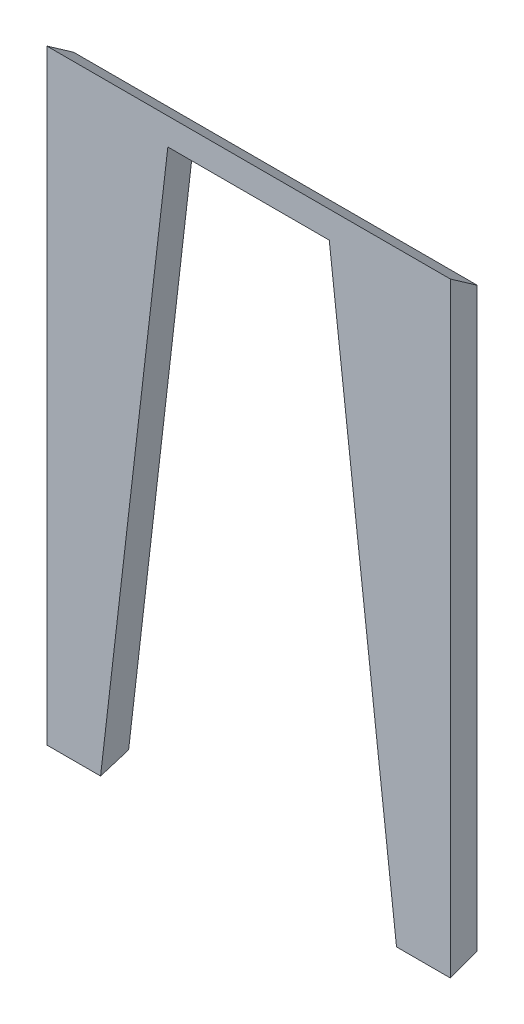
from build123d import *

# Parameters (mm, degrees)
BOSS_EXTRU_1_DEPTH      = 10
ENL_V_MAT_EXTRU_3_DEPTH = 541.925133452


with BuildPart() as part:
    # Esquisse1 → Boss.-Extru.1 (new, symmetric)
    with BuildSketch(Plane.XY):
        Polygon((0, 0), (300, 0), (300, -450), (260, -450), (210, -20), (90, -20), (40, -450), (0, -450), align=None)
    extrude(amount=BOSS_EXTRU_1_DEPTH, both=True)

    # Esquisse2 → Enl_v. mat.-Extru.3 (cut, through all)
    with BuildSketch(Plane(origin=(300, 0, 0), x_dir=(0, 0, -1), z_dir=(1, 0, 0))):
        Polygon((-10, 0), (10, -14.004150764), (10, 0), align=None)
        Polygon((-10, -450), (10, -442.720595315), (10, -450), align=None)
    extrude(amount=-ENL_V_MAT_EXTRU_3_DEPTH, mode=Mode.SUBTRACT)


solid = part.part
